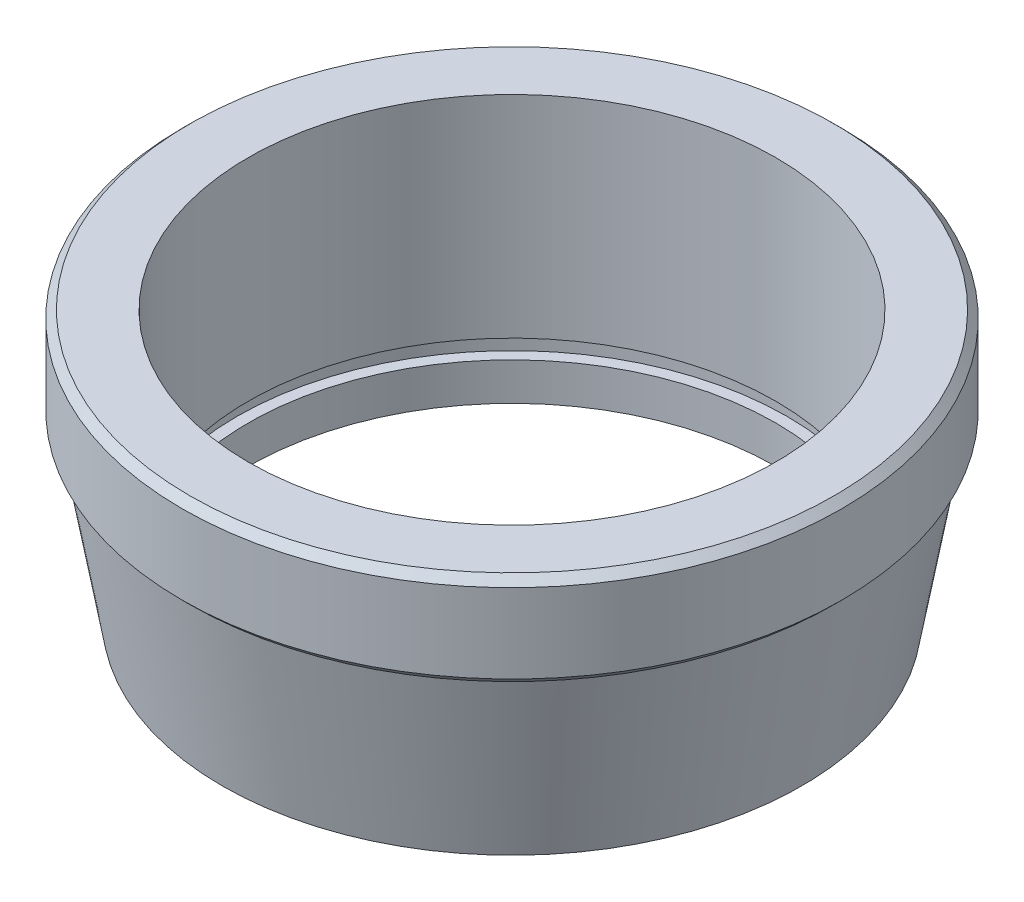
ISO-10303-21;
HEADER;
FILE_DESCRIPTION(('STEP AP214'),'2;1');
FILE_NAME('part.step','',(''),(''),'','','');
FILE_SCHEMA(('AUTOMOTIVE_DESIGN { 1 0 10303 214 1 1 1 1 }'));
ENDSEC;
DATA;
#1=APPLICATION_CONTEXT('core data for automotive mechanical design processes');
#2=APPLICATION_PROTOCOL_DEFINITION('international standard','automotive_design',2000,#1);
#3=PRODUCT_CONTEXT('',#1,'mechanical');
#4=PRODUCT('Part','Part','',(#3));
#5=PRODUCT_RELATED_PRODUCT_CATEGORY('part','',(#4));
#6=PRODUCT_DEFINITION_FORMATION('','',#4);
#7=PRODUCT_DEFINITION_CONTEXT('part definition',#1,'design');
#8=PRODUCT_DEFINITION('design','',#6,#7);
#9=PRODUCT_DEFINITION_SHAPE('','',#8);
#10=(LENGTH_UNIT() NAMED_UNIT(*) SI_UNIT(.MILLI.,.METRE.));
#11=(NAMED_UNIT(*) PLANE_ANGLE_UNIT() SI_UNIT($,.RADIAN.));
#12=(NAMED_UNIT(*) SI_UNIT($,.STERADIAN.) SOLID_ANGLE_UNIT());
#13=UNCERTAINTY_MEASURE_WITH_UNIT(LENGTH_MEASURE(1.E-05),#10,'distance_accuracy_value','');
#14=(GEOMETRIC_REPRESENTATION_CONTEXT(3) GLOBAL_UNCERTAINTY_ASSIGNED_CONTEXT((#13)) GLOBAL_UNIT_ASSIGNED_CONTEXT((#10,
#11,#12)) REPRESENTATION_CONTEXT('',''));
#15=CARTESIAN_POINT('',(0.,0.,0.));
#16=DIRECTION('',(0.,0.,1.));
#17=DIRECTION('',(1.,0.,0.));
#18=AXIS2_PLACEMENT_3D('',#15,#16,#17);
#19=CARTESIAN_POINT('',(0.,0.,0.));
#20=DIRECTION('',(0.,1.,0.));
#21=DIRECTION('',(0.,0.,1.));
#22=AXIS2_PLACEMENT_3D('',#19,#20,#21);
#23=CYLINDRICAL_SURFACE('',#22,7.);
#24=CARTESIAN_POINT('',(0.,-3.1,0.));
#25=DIRECTION('',(0.,1.,0.));
#26=DIRECTION('',(0.,0.,1.));
#27=AXIS2_PLACEMENT_3D('',#24,#25,#26);
#28=CIRCLE('',#27,7.);
#29=CARTESIAN_POINT('',(0.,-3.1,7.));
#30=VERTEX_POINT('',#29);
#31=EDGE_CURVE('E66',#30,#30,#28,.T.);
#32=ORIENTED_EDGE('',*,*,#31,.F.);
#33=EDGE_LOOP('',(#32));
#34=FACE_BOUND('',#33,.T.);
#35=CARTESIAN_POINT('',(0.,2.5,0.));
#36=DIRECTION('',(0.,1.,0.));
#37=DIRECTION('',(0.,0.,1.));
#38=AXIS2_PLACEMENT_3D('',#35,#36,#37);
#39=CIRCLE('',#38,7.);
#40=CARTESIAN_POINT('',(0.,2.5,7.));
#41=VERTEX_POINT('',#40);
#42=EDGE_CURVE('E57',#41,#41,#39,.T.);
#43=ORIENTED_EDGE('',*,*,#42,.T.);
#44=EDGE_LOOP('',(#43));
#45=FACE_BOUND('',#44,.T.);
#46=ADVANCED_FACE('F31',(#34,#45),#23,.F.);
#47=CARTESIAN_POINT('',(0.,0.,0.));
#48=DIRECTION('',(0.,1.,0.));
#49=DIRECTION('',(0.,0.,1.));
#50=AXIS2_PLACEMENT_3D('',#47,#48,#49);
#51=CONICAL_SURFACE('',#50,8.5,0.174532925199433);
#52=CARTESIAN_POINT('',(0.,-4.6,0.));
#53=DIRECTION('',(0.,1.,0.));
#54=DIRECTION('',(0.,0.,1.));
#55=AXIS2_PLACEMENT_3D('',#52,#53,#54);
#56=CIRCLE('',#55,7.68889588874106);
#57=CARTESIAN_POINT('',(0.,-4.6,7.68889588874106));
#58=VERTEX_POINT('',#57);
#59=EDGE_CURVE('E51',#58,#58,#56,.T.);
#60=ORIENTED_EDGE('',*,*,#59,.T.);
#61=EDGE_LOOP('',(#60));
#62=FACE_BOUND('',#61,.T.);
#63=CARTESIAN_POINT('',(0.,0.,0.));
#64=DIRECTION('',(0.,1.,0.));
#65=DIRECTION('',(0.,0.,1.));
#66=AXIS2_PLACEMENT_3D('',#63,#64,#65);
#67=CIRCLE('',#66,8.5);
#68=CARTESIAN_POINT('',(0.,0.,8.5));
#69=VERTEX_POINT('',#68);
#70=EDGE_CURVE('E54',#69,#69,#67,.T.);
#71=ORIENTED_EDGE('',*,*,#70,.F.);
#72=EDGE_LOOP('',(#71));
#73=FACE_BOUND('',#72,.T.);
#74=ADVANCED_FACE('F93',(#62,#73),#51,.T.);
#75=CARTESIAN_POINT('',(0.,-4.6,0.));
#76=DIRECTION('',(0.,1.,0.));
#77=DIRECTION('',(0.,0.,1.));
#78=AXIS2_PLACEMENT_3D('',#75,#76,#77);
#79=PLANE('',#78);
#80=CARTESIAN_POINT('',(0.,-4.6,0.));
#81=DIRECTION('',(0.,-1.,0.));
#82=DIRECTION('',(0.,0.,-1.));
#83=AXIS2_PLACEMENT_3D('',#80,#81,#82);
#84=CIRCLE('',#83,7.);
#85=CARTESIAN_POINT('',(0.,-4.6,-7.));
#86=VERTEX_POINT('',#85);
#87=EDGE_CURVE('E60',#86,#86,#84,.T.);
#88=ORIENTED_EDGE('',*,*,#87,.F.);
#89=EDGE_LOOP('',(#88));
#90=FACE_BOUND('',#89,.T.);
#91=ORIENTED_EDGE('',*,*,#59,.F.);
#92=EDGE_LOOP('',(#91));
#93=FACE_BOUND('',#92,.T.);
#94=ADVANCED_FACE('F108',(#90,#93),#79,.F.);
#95=CARTESIAN_POINT('',(0.,2.5,0.));
#96=DIRECTION('',(0.,-1.,0.));
#97=DIRECTION('',(0.,0.,-1.));
#98=AXIS2_PLACEMENT_3D('',#95,#96,#97);
#99=CYLINDRICAL_SURFACE('',#98,8.75);
#100=CARTESIAN_POINT('',(0.,0.200000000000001,0.));
#101=DIRECTION('',(0.,1.,0.));
#102=DIRECTION('',(0.,0.,1.));
#103=AXIS2_PLACEMENT_3D('',#100,#101,#102);
#104=CIRCLE('',#103,8.75);
#105=CARTESIAN_POINT('',(0.,0.200000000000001,8.75));
#106=VERTEX_POINT('',#105);
#107=EDGE_CURVE('E42',#106,#106,#104,.T.);
#108=ORIENTED_EDGE('',*,*,#107,.T.);
#109=EDGE_LOOP('',(#108));
#110=FACE_BOUND('',#109,.T.);
#111=CARTESIAN_POINT('',(0.,2.29999999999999,0.));
#112=DIRECTION('',(0.,1.,0.));
#113=DIRECTION('',(0.,0.,1.));
#114=AXIS2_PLACEMENT_3D('',#111,#112,#113);
#115=CIRCLE('',#114,8.75);
#116=CARTESIAN_POINT('',(0.,2.29999999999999,8.75));
#117=VERTEX_POINT('',#116);
#118=EDGE_CURVE('E46',#117,#117,#115,.F.);
#119=ORIENTED_EDGE('',*,*,#118,.T.);
#120=EDGE_LOOP('',(#119));
#121=FACE_BOUND('',#120,.T.);
#122=ADVANCED_FACE('F100',(#110,#121),#99,.T.);
#123=CARTESIAN_POINT('',(0.,2.5,0.));
#124=DIRECTION('',(0.,1.,0.));
#125=DIRECTION('',(0.,0.,1.));
#126=AXIS2_PLACEMENT_3D('',#123,#124,#125);
#127=PLANE('',#126);
#128=ORIENTED_EDGE('',*,*,#42,.F.);
#129=EDGE_LOOP('',(#128));
#130=FACE_BOUND('',#129,.T.);
#131=CARTESIAN_POINT('',(0.,2.5,0.));
#132=DIRECTION('',(0.,1.,0.));
#133=DIRECTION('',(0.,0.,1.));
#134=AXIS2_PLACEMENT_3D('',#131,#132,#133);
#135=CIRCLE('',#134,8.55);
#136=CARTESIAN_POINT('',(0.,2.5,8.55));
#137=VERTEX_POINT('',#136);
#138=EDGE_CURVE('E10',#137,#137,#135,.T.);
#139=ORIENTED_EDGE('',*,*,#138,.T.);
#140=EDGE_LOOP('',(#139));
#141=FACE_BOUND('',#140,.T.);
#142=ADVANCED_FACE('F97',(#130,#141),#127,.T.);
#143=CARTESIAN_POINT('',(0.,0.,0.));
#144=DIRECTION('',(0.,1.,0.));
#145=DIRECTION('',(0.,0.,1.));
#146=AXIS2_PLACEMENT_3D('',#143,#144,#145);
#147=PLANE('',#146);
#148=CARTESIAN_POINT('',(0.,0.,0.));
#149=DIRECTION('',(0.,1.,0.));
#150=DIRECTION('',(0.,0.,1.));
#151=AXIS2_PLACEMENT_3D('',#148,#149,#150);
#152=CIRCLE('',#151,8.55);
#153=CARTESIAN_POINT('',(0.,0.,8.55));
#154=VERTEX_POINT('',#153);
#155=EDGE_CURVE('E38',#154,#154,#152,.F.);
#156=ORIENTED_EDGE('',*,*,#155,.T.);
#157=EDGE_LOOP('',(#156));
#158=FACE_BOUND('',#157,.T.);
#159=ORIENTED_EDGE('',*,*,#70,.T.);
#160=EDGE_LOOP('',(#159));
#161=FACE_BOUND('',#160,.T.);
#162=ADVANCED_FACE('F99',(#158,#161),#147,.F.);
#163=CARTESIAN_POINT('',(0.,0.200000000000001,0.));
#164=DIRECTION('',(0.,1.,0.));
#165=DIRECTION('',(0.,0.,1.));
#166=AXIS2_PLACEMENT_3D('',#163,#164,#165);
#167=CONICAL_SURFACE('',#166,8.75,0.785398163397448);
#168=ORIENTED_EDGE('',*,*,#155,.F.);
#169=EDGE_LOOP('',(#168));
#170=FACE_BOUND('',#169,.T.);
#171=ORIENTED_EDGE('',*,*,#107,.F.);
#172=EDGE_LOOP('',(#171));
#173=FACE_BOUND('',#172,.T.);
#174=ADVANCED_FACE('F106',(#170,#173),#167,.T.);
#175=CARTESIAN_POINT('',(0.,2.5,0.));
#176=DIRECTION('',(0.,-1.,0.));
#177=DIRECTION('',(0.,0.,-1.));
#178=AXIS2_PLACEMENT_3D('',#175,#176,#177);
#179=CONICAL_SURFACE('',#178,8.55,0.785398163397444);
#180=ORIENTED_EDGE('',*,*,#118,.F.);
#181=EDGE_LOOP('',(#180));
#182=FACE_BOUND('',#181,.T.);
#183=ORIENTED_EDGE('',*,*,#138,.F.);
#184=EDGE_LOOP('',(#183));
#185=FACE_BOUND('',#184,.T.);
#186=ADVANCED_FACE('F33',(#182,#185),#179,.T.);
#187=CARTESIAN_POINT('',(0.,-3.6,0.));
#188=DIRECTION('',(0.,1.,0.));
#189=DIRECTION('',(0.,0.,1.));
#190=AXIS2_PLACEMENT_3D('',#187,#188,#189);
#191=CIRCLE('',#190,7.);
#192=CARTESIAN_POINT('',(0.,-3.6,7.));
#193=VERTEX_POINT('',#192);
#194=EDGE_CURVE('E69',#193,#193,#191,.T.);
#195=ORIENTED_EDGE('',*,*,#194,.T.);
#196=EDGE_LOOP('',(#195));
#197=FACE_BOUND('',#196,.T.);
#198=ORIENTED_EDGE('',*,*,#87,.T.);
#199=EDGE_LOOP('',(#198));
#200=FACE_BOUND('',#199,.T.);
#201=ADVANCED_FACE('F82',(#197,#200),#23,.F.);
#202=CARTESIAN_POINT('',(0.,2.5,0.));
#203=DIRECTION('',(0.,1.,0.));
#204=DIRECTION('',(0.,0.,1.));
#205=AXIS2_PLACEMENT_3D('',#202,#203,#204);
#206=CYLINDRICAL_SURFACE('',#205,7.3);
#207=CARTESIAN_POINT('',(0.,-3.6,0.));
#208=DIRECTION('',(0.,1.,0.));
#209=DIRECTION('',(0.,0.,1.));
#210=AXIS2_PLACEMENT_3D('',#207,#208,#209);
#211=CIRCLE('',#210,7.3);
#212=CARTESIAN_POINT('',(0.,-3.6,7.3));
#213=VERTEX_POINT('',#212);
#214=EDGE_CURVE('E72',#213,#213,#211,.T.);
#215=ORIENTED_EDGE('',*,*,#214,.F.);
#216=EDGE_LOOP('',(#215));
#217=FACE_BOUND('',#216,.T.);
#218=CARTESIAN_POINT('',(0.,-3.1,0.));
#219=DIRECTION('',(0.,1.,0.));
#220=DIRECTION('',(0.,0.,1.));
#221=AXIS2_PLACEMENT_3D('',#218,#219,#220);
#222=CIRCLE('',#221,7.3);
#223=CARTESIAN_POINT('',(0.,-3.1,7.3));
#224=VERTEX_POINT('',#223);
#225=EDGE_CURVE('E63',#224,#224,#222,.T.);
#226=ORIENTED_EDGE('',*,*,#225,.T.);
#227=EDGE_LOOP('',(#226));
#228=FACE_BOUND('',#227,.T.);
#229=ADVANCED_FACE('F78',(#217,#228),#206,.F.);
#230=CARTESIAN_POINT('',(-7.3,-3.1,0.));
#231=DIRECTION('',(0.,1.,0.));
#232=DIRECTION('',(0.,0.,1.));
#233=AXIS2_PLACEMENT_3D('',#230,#231,#232);
#234=PLANE('',#233);
#235=ORIENTED_EDGE('',*,*,#225,.F.);
#236=EDGE_LOOP('',(#235));
#237=FACE_BOUND('',#236,.T.);
#238=ORIENTED_EDGE('',*,*,#31,.T.);
#239=EDGE_LOOP('',(#238));
#240=FACE_BOUND('',#239,.T.);
#241=ADVANCED_FACE('F81',(#237,#240),#234,.F.);
#242=CARTESIAN_POINT('',(-7.3,-3.6,0.));
#243=DIRECTION('',(0.,-1.,0.));
#244=DIRECTION('',(0.,0.,-1.));
#245=AXIS2_PLACEMENT_3D('',#242,#243,#244);
#246=PLANE('',#245);
#247=ORIENTED_EDGE('',*,*,#194,.F.);
#248=EDGE_LOOP('',(#247));
#249=FACE_BOUND('',#248,.T.);
#250=ORIENTED_EDGE('',*,*,#214,.T.);
#251=EDGE_LOOP('',(#250));
#252=FACE_BOUND('',#251,.T.);
#253=ADVANCED_FACE('F76',(#249,#252),#246,.F.);
#254=CLOSED_SHELL('',(#46,#74,#94,#122,#142,#162,#174,#186,#201,#229,#241,#253));
#255=MANIFOLD_SOLID_BREP('B2',#254);
#256=ADVANCED_BREP_SHAPE_REPRESENTATION('',(#18,#255),#14);
#257=SHAPE_DEFINITION_REPRESENTATION(#9,#256);
ENDSEC;
END-ISO-10303-21;
